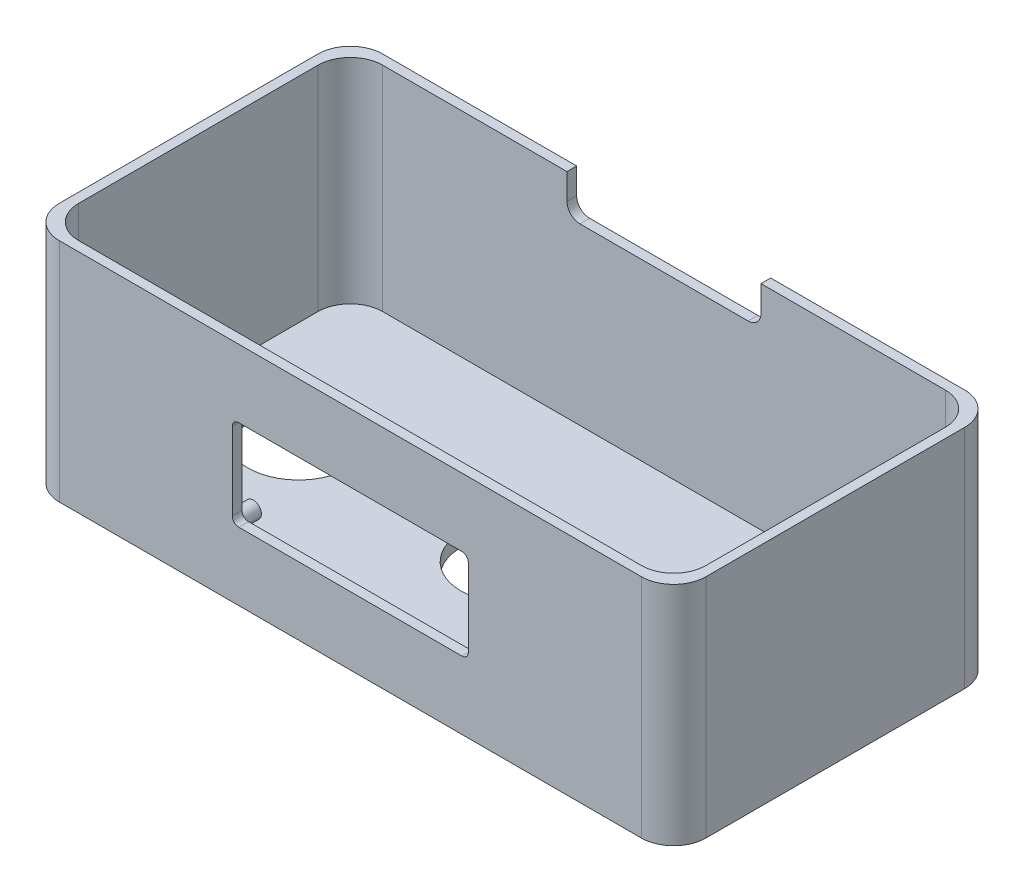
from build123d import *

# Parameters (mm, degrees)
SKETCH_1_R          = 15.722142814
EXTRUDE_1_DEPTH     = 70
CUT_EXTRUDE_1_DEPTH = 66
CUT_EXTRUDE_2_DEPTH = 66
CUT_EXTRUDE_3_DEPTH = 10
SKETCH_5_R          = 2.5
SKETCH_5_R_2        = 1.5
EXTRUDE_2_DEPTH     = 6


with BuildPart() as part:
    # Sketch 1 → Extrude 1 (new body)
    with BuildSketch(Plane(origin=(0, 0, 0), x_dir=(1, 0, 0), z_dir=(0, 1, 0))):
        with BuildLine():
            Line((10, 0), (190, 0))
            ThreePointArc((190, 0), (197.071067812, -2.928932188), (200, -10))
            Line((200, -10), (200, -90))
            ThreePointArc((200, -90), (197.071067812, -97.071067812), (190, -100))
            Line((190, -100), (10, -100))
            ThreePointArc((10, -100), (2.928932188, -97.071067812), (0, -90))
            Line((0, -90), (0, -10))
            ThreePointArc((0, -10), (2.928932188, -2.928932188), (10, 0))
        make_face()
        with Locations(Location((100, -50, 0), (0, 0, 270))):
            Circle(SKETCH_1_R, mode=Mode.SUBTRACT)
        with Locations(Location((166, -50, 0), (0, 0, 270))):
            Circle(SKETCH_1_R, mode=Mode.SUBTRACT)
        with Locations(Location((34, -50, 0), (0, 0, 270))):
            Circle(SKETCH_1_R, mode=Mode.SUBTRACT)
    extrude(amount=EXTRUDE_1_DEPTH)

    # Sketch 2 → Cut-Extrude 1 (cut)
    with BuildSketch(Plane(origin=(0, 70, 0), x_dir=(1, 0, 0), z_dir=(0, 1, 0))):
        with BuildLine():
            Line((13, -3), (187, -3))
            ThreePointArc((187, -3), (194.071067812, -5.928932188), (197, -13))
            Line((197, -13), (197, -87))
            ThreePointArc((197, -87), (194.071067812, -94.071067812), (187, -97))
            Line((187, -97), (13, -97))
            ThreePointArc((13, -97), (5.928932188, -94.071067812), (3, -87))
            Line((3, -87), (3, -13))
            ThreePointArc((3, -13), (5.928932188, -5.928932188), (13, -3))
        make_face()
    extrude(amount=-CUT_EXTRUDE_1_DEPTH, mode=Mode.SUBTRACT)

    # Sketch 3 → Cut-Extrude 2 (cut)
    with BuildSketch(Plane(origin=(0, 0, 0), x_dir=(-1, 0, 0), z_dir=(0, 0, -1))):
        with BuildLine():
            Line((-130, 70), (-70, 70))
            Line((-70, 70), (-70, 62))
            ThreePointArc((-70, 62), (-71.171572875, 59.171572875), (-74, 58))
            Line((-74, 58), (-126, 58))
            ThreePointArc((-126, 58), (-128.828427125, 59.171572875), (-130, 62))
            Line((-130, 62), (-130, 70))
        make_face()
    extrude(amount=-CUT_EXTRUDE_2_DEPTH, mode=Mode.SUBTRACT)

    # Sketch 4 → Cut-Extrude 3 (cut)
    with BuildSketch(Plane.XY.offset(100)):
        with BuildLine():
            Line((65.5, 49), (134.5, 49))
            ThreePointArc((134.5, 49), (135.914213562, 48.414213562), (136.5, 47))
            Line((136.5, 47), (136.5, 23))
            ThreePointArc((136.5, 23), (135.914213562, 21.585786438), (134.5, 21))
            Line((134.5, 21), (65.5, 21))
            ThreePointArc((65.5, 21), (64.085786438, 21.585786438), (63.5, 23))
            Line((63.5, 23), (63.5, 47))
            ThreePointArc((63.5, 47), (64.085786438, 48.414213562), (65.5, 49))
        make_face()
    extrude(amount=-CUT_EXTRUDE_3_DEPTH, mode=Mode.SUBTRACT)

    # Sketch 5 → Extrude 2 (add)
    # profile 1 of 4: a face of its own
    with BuildSketch(Plane(origin=(0, 0, 97), x_dir=(-1, 0, 0), z_dir=(0, 0, -1))):
        with Locations(Location((-139, 50.968626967, 0), (0, 0, 180))):
            Circle(SKETCH_5_R)
        with Locations((-139, 50.968626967)):
            Circle(SKETCH_5_R_2, mode=Mode.SUBTRACT)
    # profile 2 of 4: a face of its own
    with BuildSketch(Plane(origin=(0, 0, 97), x_dir=(-1, 0, 0), z_dir=(0, 0, -1))):
        with Locations(Location((-139, 19.031373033, 0), (0, 0, 180))):
            Circle(SKETCH_5_R)
        with Locations(Location((-139, 19.031373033, 0), (0, 0, 180))):
            Circle(SKETCH_5_R_2, mode=Mode.SUBTRACT)
    # profile 3 of 4: a face of its own
    with BuildSketch(Plane(origin=(0, 0, 97), x_dir=(-1, 0, 0), z_dir=(0, 0, -1))):
        with Locations(Location((-61, 19.031373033, 0), (0, 0, 180))):
            Circle(SKETCH_5_R)
        with Locations((-61, 19.031373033)):
            Circle(SKETCH_5_R_2, mode=Mode.SUBTRACT)
    # profile 4 of 4: a face of its own
    with BuildSketch(Plane(origin=(0, 0, 97), x_dir=(-1, 0, 0), z_dir=(0, 0, -1))):
        with Locations(Location((-61, 50.968626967, 0), (0, 0, 180))):
            Circle(SKETCH_5_R)
        with Locations(Location((-61, 50.968626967, 0), (0, 0, 180))):
            Circle(SKETCH_5_R_2, mode=Mode.SUBTRACT)
    extrude(amount=EXTRUDE_2_DEPTH)


solid = part.part
